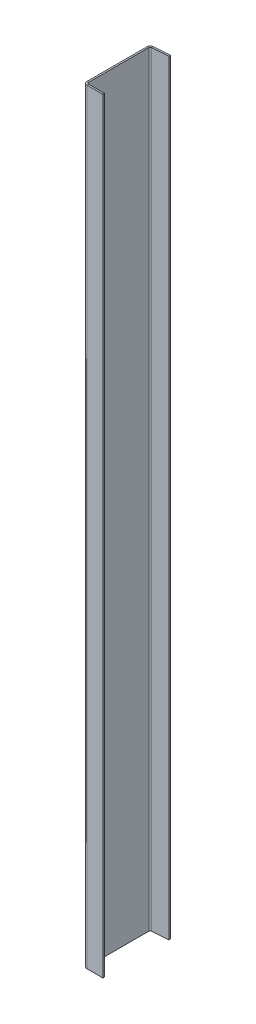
ISO-10303-21;
HEADER;
FILE_DESCRIPTION(('STEP AP214'),'2;1');
FILE_NAME('part.step','',(''),(''),'','','');
FILE_SCHEMA(('AUTOMOTIVE_DESIGN { 1 0 10303 214 1 1 1 1 }'));
ENDSEC;
DATA;
#1=APPLICATION_CONTEXT('core data for automotive mechanical design processes');
#2=APPLICATION_PROTOCOL_DEFINITION('international standard','automotive_design',2000,#1);
#3=PRODUCT_CONTEXT('',#1,'mechanical');
#4=PRODUCT('Part','Part','',(#3));
#5=PRODUCT_RELATED_PRODUCT_CATEGORY('part','',(#4));
#6=PRODUCT_DEFINITION_FORMATION('','',#4);
#7=PRODUCT_DEFINITION_CONTEXT('part definition',#1,'design');
#8=PRODUCT_DEFINITION('design','',#6,#7);
#9=PRODUCT_DEFINITION_SHAPE('','',#8);
#10=(LENGTH_UNIT() NAMED_UNIT(*) SI_UNIT(.MILLI.,.METRE.));
#11=(NAMED_UNIT(*) PLANE_ANGLE_UNIT() SI_UNIT($,.RADIAN.));
#12=(NAMED_UNIT(*) SI_UNIT($,.STERADIAN.) SOLID_ANGLE_UNIT());
#13=UNCERTAINTY_MEASURE_WITH_UNIT(LENGTH_MEASURE(1.E-05),#10,'distance_accuracy_value','');
#14=(GEOMETRIC_REPRESENTATION_CONTEXT(3) GLOBAL_UNCERTAINTY_ASSIGNED_CONTEXT((#13)) GLOBAL_UNIT_ASSIGNED_CONTEXT((#10,
#11,#12)) REPRESENTATION_CONTEXT('',''));
#15=CARTESIAN_POINT('',(0.,0.,0.));
#16=DIRECTION('',(0.,0.,1.));
#17=DIRECTION('',(1.,0.,0.));
#18=AXIS2_PLACEMENT_3D('',#15,#16,#17);
#19=CARTESIAN_POINT('',(-3.99680288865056E-12,3048.,-12.6999999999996));
#20=DIRECTION('',(0.,1.,0.));
#21=DIRECTION('',(0.,0.,0.999999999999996));
#22=AXIS2_PLACEMENT_3D('',#19,#20,#21);
#23=PLANE('',#22);
#24=DIRECTION('',(1.,0.,0.));
#25=VECTOR('',#24,1.);
#26=CARTESIAN_POINT('',(-3.99680288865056E-12,3048.,-12.6999999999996));
#27=LINE('',#26,#25);
#28=CARTESIAN_POINT('',(-3.99680288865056E-12,3048.,-12.6999999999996));
#29=VERTEX_POINT('',#28);
#30=CARTESIAN_POINT('',(6.34999999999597,3048.,-12.6999999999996));
#31=VERTEX_POINT('',#30);
#32=EDGE_CURVE('E11',#29,#31,#27,.T.);
#33=ORIENTED_EDGE('',*,*,#32,.F.);
#34=CARTESIAN_POINT('',(12.699999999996,3048.,-12.6999999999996));
#35=DIRECTION('',(0.,1.,0.));
#36=DIRECTION('',(0.,0.,0.999999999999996));
#37=AXIS2_PLACEMENT_3D('',#34,#35,#36);
#38=CIRCLE('',#37,12.7);
#39=CARTESIAN_POINT('',(12.6999999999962,3048.,3.84132829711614E-13));
#40=VERTEX_POINT('',#39);
#41=EDGE_CURVE('E246',#40,#29,#38,.F.);
#42=ORIENTED_EDGE('',*,*,#41,.F.);
#43=DIRECTION('',(0.,0.,0.999999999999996));
#44=VECTOR('',#43,1.);
#45=CARTESIAN_POINT('',(12.699999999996,3048.,-6.3499999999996));
#46=LINE('',#45,#44);
#47=CARTESIAN_POINT('',(12.699999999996,3048.,-6.3499999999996));
#48=VERTEX_POINT('',#47);
#49=EDGE_CURVE('E44',#48,#40,#46,.T.);
#50=ORIENTED_EDGE('',*,*,#49,.F.);
#51=CARTESIAN_POINT('',(12.699999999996,3048.,-12.6999999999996));
#52=DIRECTION('',(0.,1.,0.));
#53=DIRECTION('',(1.,0.,0.));
#54=AXIS2_PLACEMENT_3D('',#51,#52,#53);
#55=CIRCLE('',#54,6.35);
#56=EDGE_CURVE('E145',#48,#31,#55,.F.);
#57=ORIENTED_EDGE('',*,*,#56,.T.);
#58=EDGE_LOOP('',(#33,#42,#50,#57));
#59=FACE_BOUND('',#58,.T.);
#60=ADVANCED_FACE('F36',(#59),#23,.T.);
#61=CARTESIAN_POINT('',(12.699999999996,3048.,-6.3499999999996));
#62=DIRECTION('',(0.,1.,0.));
#63=DIRECTION('',(0.,0.,0.999999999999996));
#64=AXIS2_PLACEMENT_3D('',#61,#62,#63);
#65=PLANE('',#64);
#66=DIRECTION('',(0.,0.,-0.999999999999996));
#67=VECTOR('',#66,1.);
#68=CARTESIAN_POINT('',(-3.99680288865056E-12,3048.,3.82506526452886E-13));
#69=LINE('',#68,#67);
#70=CARTESIAN_POINT('',(-3.99680288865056E-12,3048.,-251.682058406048));
#71=VERTEX_POINT('',#70);
#72=EDGE_CURVE('E139',#29,#71,#69,.T.);
#73=ORIENTED_EDGE('',*,*,#72,.F.);
#74=ORIENTED_EDGE('',*,*,#32,.T.);
#75=DIRECTION('',(0.,0.,-0.999999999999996));
#76=VECTOR('',#75,1.);
#77=CARTESIAN_POINT('',(6.34999999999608,3048.,3.82506526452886E-13));
#78=LINE('',#77,#76);
#79=CARTESIAN_POINT('',(6.34999999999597,3048.,-251.682058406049));
#80=VERTEX_POINT('',#79);
#81=EDGE_CURVE('E136',#31,#80,#78,.T.);
#82=ORIENTED_EDGE('',*,*,#81,.T.);
#83=DIRECTION('',(-1.,0.,0.));
#84=VECTOR('',#83,1.);
#85=CARTESIAN_POINT('',(6.34999999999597,3048.,-251.682058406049));
#86=LINE('',#85,#84);
#87=EDGE_CURVE('E227',#80,#71,#86,.T.);
#88=ORIENTED_EDGE('',*,*,#87,.T.);
#89=EDGE_LOOP('',(#73,#74,#82,#88));
#90=FACE_BOUND('',#89,.T.);
#91=ADVANCED_FACE('F134',(#90),#65,.T.);
#92=CARTESIAN_POINT('',(12.7,0.,0.));
#93=DIRECTION('',(0.,-1.,0.));
#94=DIRECTION('',(0.,0.,-0.999999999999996));
#95=AXIS2_PLACEMENT_3D('',#92,#93,#94);
#96=PLANE('',#95);
#97=DIRECTION('',(0.,0.,-0.999999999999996));
#98=VECTOR('',#97,1.);
#99=CARTESIAN_POINT('',(12.7,0.,0.));
#100=LINE('',#99,#98);
#101=CARTESIAN_POINT('',(12.7,0.,0.));
#102=VERTEX_POINT('',#101);
#103=CARTESIAN_POINT('',(12.7,0.,-6.34999999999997));
#104=VERTEX_POINT('',#103);
#105=EDGE_CURVE('E232',#102,#104,#100,.T.);
#106=ORIENTED_EDGE('',*,*,#105,.F.);
#107=CARTESIAN_POINT('',(12.6999999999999,0.,-12.6999999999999));
#108=DIRECTION('',(0.,1.,0.));
#109=DIRECTION('',(0.,0.,0.999999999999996));
#110=AXIS2_PLACEMENT_3D('',#107,#108,#109);
#111=CIRCLE('',#110,12.7);
#112=CARTESIAN_POINT('',(0.,0.,-12.6999999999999));
#113=VERTEX_POINT('',#112);
#114=EDGE_CURVE('E184',#102,#113,#111,.F.);
#115=ORIENTED_EDGE('',*,*,#114,.T.);
#116=DIRECTION('',(-1.,0.,0.));
#117=VECTOR('',#116,1.);
#118=CARTESIAN_POINT('',(6.34999999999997,0.,-12.6999999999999));
#119=LINE('',#118,#117);
#120=CARTESIAN_POINT('',(6.34999999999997,0.,-12.6999999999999));
#121=VERTEX_POINT('',#120);
#122=EDGE_CURVE('E230',#121,#113,#119,.T.);
#123=ORIENTED_EDGE('',*,*,#122,.F.);
#124=CARTESIAN_POINT('',(12.6999999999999,0.,-12.6999999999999));
#125=DIRECTION('',(0.,1.,0.));
#126=DIRECTION('',(1.,0.,0.));
#127=AXIS2_PLACEMENT_3D('',#124,#125,#126);
#128=CIRCLE('',#127,6.35);
#129=EDGE_CURVE('E157',#104,#121,#128,.F.);
#130=ORIENTED_EDGE('',*,*,#129,.F.);
#131=EDGE_LOOP('',(#106,#115,#123,#130));
#132=FACE_BOUND('',#131,.T.);
#133=ADVANCED_FACE('F284',(#132),#96,.T.);
#134=CARTESIAN_POINT('',(6.34999999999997,0.,-12.6999999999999));
#135=DIRECTION('',(0.,-1.,0.));
#136=DIRECTION('',(0.,0.,-0.999999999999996));
#137=AXIS2_PLACEMENT_3D('',#134,#135,#136);
#138=PLANE('',#137);
#139=DIRECTION('',(-1.,0.,0.));
#140=VECTOR('',#139,1.);
#141=CARTESIAN_POINT('',(76.2,0.,0.));
#142=LINE('',#141,#140);
#143=CARTESIAN_POINT('',(76.2,0.,0.));
#144=VERTEX_POINT('',#143);
#145=EDGE_CURVE('E187',#144,#102,#142,.T.);
#146=ORIENTED_EDGE('',*,*,#145,.T.);
#147=ORIENTED_EDGE('',*,*,#105,.T.);
#148=DIRECTION('',(-1.,0.,0.));
#149=VECTOR('',#148,1.);
#150=CARTESIAN_POINT('',(76.1999999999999,0.,-6.34999999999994));
#151=LINE('',#150,#149);
#152=CARTESIAN_POINT('',(76.1999999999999,0.,-6.34999999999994));
#153=VERTEX_POINT('',#152);
#154=EDGE_CURVE('E193',#153,#104,#151,.T.);
#155=ORIENTED_EDGE('',*,*,#154,.F.);
#156=DIRECTION('',(0.,0.,0.999999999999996));
#157=VECTOR('',#156,1.);
#158=CARTESIAN_POINT('',(76.1999999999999,0.,-6.34999999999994));
#159=LINE('',#158,#157);
#160=EDGE_CURVE('E190',#153,#144,#159,.T.);
#161=ORIENTED_EDGE('',*,*,#160,.T.);
#162=EDGE_LOOP('',(#146,#147,#155,#161));
#163=FACE_BOUND('',#162,.T.);
#164=ADVANCED_FACE('F287',(#163),#138,.T.);
#165=CARTESIAN_POINT('',(11.8140927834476,3048.,-264.351121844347));
#166=DIRECTION('',(0.,1.,0.));
#167=DIRECTION('',(0.,0.,0.999999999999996));
#168=AXIS2_PLACEMENT_3D('',#165,#166,#167);
#169=PLANE('',#168);
#170=DIRECTION('',(0.0697564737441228,0.,0.99756405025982));
#171=VECTOR('',#170,1.);
#172=CARTESIAN_POINT('',(11.8140927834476,3048.,-264.351121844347));
#173=LINE('',#172,#171);
#174=CARTESIAN_POINT('',(11.8140927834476,3048.,-264.351121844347));
#175=VERTEX_POINT('',#174);
#176=CARTESIAN_POINT('',(12.2570463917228,3048.,-258.016590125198));
#177=VERTEX_POINT('',#176);
#178=EDGE_CURVE('E52',#175,#177,#173,.T.);
#179=ORIENTED_EDGE('',*,*,#178,.F.);
#180=CARTESIAN_POINT('',(12.699999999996,3048.,-251.682058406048));
#181=DIRECTION('',(0.,1.,0.));
#182=DIRECTION('',(0.,0.,0.999999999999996));
#183=AXIS2_PLACEMENT_3D('',#180,#181,#182);
#184=CIRCLE('',#183,12.7);
#185=EDGE_CURVE('E256',#71,#175,#184,.F.);
#186=ORIENTED_EDGE('',*,*,#185,.F.);
#187=ORIENTED_EDGE('',*,*,#87,.F.);
#188=CARTESIAN_POINT('',(12.699999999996,3048.,-251.682058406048));
#189=DIRECTION('',(0.,1.,0.));
#190=DIRECTION('',(1.,0.,0.));
#191=AXIS2_PLACEMENT_3D('',#188,#189,#190);
#192=CIRCLE('',#191,6.35);
#193=EDGE_CURVE('E165',#80,#177,#192,.F.);
#194=ORIENTED_EDGE('',*,*,#193,.T.);
#195=EDGE_LOOP('',(#179,#186,#187,#194));
#196=FACE_BOUND('',#195,.T.);
#197=ADVANCED_FACE('F279',(#196),#169,.T.);
#198=CARTESIAN_POINT('',(6.34999999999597,3048.,-251.682058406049));
#199=DIRECTION('',(0.,1.,0.));
#200=DIRECTION('',(0.,0.,0.999999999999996));
#201=AXIS2_PLACEMENT_3D('',#198,#199,#200);
#202=PLANE('',#201);
#203=DIRECTION('',(0.997564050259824,0.,-0.0697564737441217));
#204=VECTOR('',#203,1.);
#205=CARTESIAN_POINT('',(-1.99840144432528E-12,3048.,-263.524999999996));
#206=LINE('',#205,#204);
#207=CARTESIAN_POINT('',(76.0143806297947,3048.,-268.840443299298));
#208=VERTEX_POINT('',#207);
#209=EDGE_CURVE('E259',#175,#208,#206,.T.);
#210=ORIENTED_EDGE('',*,*,#209,.F.);
#211=ORIENTED_EDGE('',*,*,#178,.T.);
#212=DIRECTION('',(0.997564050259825,0.,-0.0697564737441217));
#213=VECTOR('',#212,1.);
#214=CARTESIAN_POINT('',(0.442953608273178,3048.,-257.190468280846));
#215=LINE('',#214,#213);
#216=CARTESIAN_POINT('',(76.4573342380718,3048.,-262.505911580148));
#217=VERTEX_POINT('',#216);
#218=EDGE_CURVE('E106',#177,#217,#215,.T.);
#219=ORIENTED_EDGE('',*,*,#218,.T.);
#220=DIRECTION('',(0.0697564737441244,0.,0.99756405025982));
#221=VECTOR('',#220,1.);
#222=CARTESIAN_POINT('',(76.0143806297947,3048.,-268.840443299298));
#223=LINE('',#222,#221);
#224=EDGE_CURVE('E262',#208,#217,#223,.T.);
#225=ORIENTED_EDGE('',*,*,#224,.F.);
#226=EDGE_LOOP('',(#210,#211,#219,#225));
#227=FACE_BOUND('',#226,.T.);
#228=ADVANCED_FACE('F268',(#227),#202,.T.);
#229=CARTESIAN_POINT('',(0.,0.,-251.682058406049));
#230=DIRECTION('',(0.,-1.,0.));
#231=DIRECTION('',(0.,0.,-0.999999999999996));
#232=AXIS2_PLACEMENT_3D('',#229,#230,#231);
#233=PLANE('',#232);
#234=DIRECTION('',(1.,0.,0.));
#235=VECTOR('',#234,1.);
#236=CARTESIAN_POINT('',(0.,0.,-251.682058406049));
#237=LINE('',#236,#235);
#238=CARTESIAN_POINT('',(0.,0.,-251.682058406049));
#239=VERTEX_POINT('',#238);
#240=CARTESIAN_POINT('',(6.34999999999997,0.,-251.68205840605));
#241=VERTEX_POINT('',#240);
#242=EDGE_CURVE('E93',#239,#241,#237,.T.);
#243=ORIENTED_EDGE('',*,*,#242,.F.);
#244=CARTESIAN_POINT('',(12.6999999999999,0.,-251.682058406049));
#245=DIRECTION('',(0.,1.,0.));
#246=DIRECTION('',(0.,0.,0.999999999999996));
#247=AXIS2_PLACEMENT_3D('',#244,#245,#246);
#248=CIRCLE('',#247,12.7);
#249=CARTESIAN_POINT('',(11.8140927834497,0.,-264.351121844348));
#250=VERTEX_POINT('',#249);
#251=EDGE_CURVE('E180',#239,#250,#248,.F.);
#252=ORIENTED_EDGE('',*,*,#251,.T.);
#253=DIRECTION('',(-0.0697564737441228,0.,-0.99756405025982));
#254=VECTOR('',#253,1.);
#255=CARTESIAN_POINT('',(12.2570463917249,0.,-258.016590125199));
#256=LINE('',#255,#254);
#257=CARTESIAN_POINT('',(12.2570463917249,0.,-258.016590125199));
#258=VERTEX_POINT('',#257);
#259=EDGE_CURVE('E100',#258,#250,#256,.T.);
#260=ORIENTED_EDGE('',*,*,#259,.F.);
#261=CARTESIAN_POINT('',(12.6999999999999,0.,-251.682058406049));
#262=DIRECTION('',(0.,1.,0.));
#263=DIRECTION('',(1.,0.,0.));
#264=AXIS2_PLACEMENT_3D('',#261,#262,#263);
#265=CIRCLE('',#264,6.35);
#266=EDGE_CURVE('E199',#241,#258,#265,.F.);
#267=ORIENTED_EDGE('',*,*,#266,.F.);
#268=EDGE_LOOP('',(#243,#252,#260,#267));
#269=FACE_BOUND('',#268,.T.);
#270=ADVANCED_FACE('F316',(#269),#233,.T.);
#271=CARTESIAN_POINT('',(12.2570463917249,0.,-258.016590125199));
#272=DIRECTION('',(0.,-1.,0.));
#273=DIRECTION('',(0.,0.,-0.999999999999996));
#274=AXIS2_PLACEMENT_3D('',#271,#272,#273);
#275=PLANE('',#274);
#276=DIRECTION('',(0.,0.,-0.999999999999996));
#277=VECTOR('',#276,1.);
#278=CARTESIAN_POINT('',(0.,0.,0.));
#279=LINE('',#278,#277);
#280=EDGE_CURVE('E182',#113,#239,#279,.T.);
#281=ORIENTED_EDGE('',*,*,#280,.T.);
#282=ORIENTED_EDGE('',*,*,#242,.T.);
#283=DIRECTION('',(0.,0.,-0.999999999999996));
#284=VECTOR('',#283,1.);
#285=CARTESIAN_POINT('',(6.34999999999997,0.,0.));
#286=LINE('',#285,#284);
#287=EDGE_CURVE('E197',#121,#241,#286,.T.);
#288=ORIENTED_EDGE('',*,*,#287,.F.);
#289=ORIENTED_EDGE('',*,*,#122,.T.);
#290=EDGE_LOOP('',(#281,#282,#288,#289));
#291=FACE_BOUND('',#290,.T.);
#292=ADVANCED_FACE('F319',(#291),#275,.T.);
#293=CARTESIAN_POINT('',(0.442953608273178,3048.,-257.190468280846));
#294=DIRECTION('',(-0.0697564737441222,0.,-0.99756405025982));
#295=DIRECTION('',(-0.997564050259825,0.,0.0697564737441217));
#296=AXIS2_PLACEMENT_3D('',#293,#294,#295);
#297=PLANE('',#296);
#298=DIRECTION('',(0.997564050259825,0.,-0.0697564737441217));
#299=VECTOR('',#298,1.);
#300=CARTESIAN_POINT('',(0.442953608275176,0.,-257.190468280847));
#301=LINE('',#300,#299);
#302=CARTESIAN_POINT('',(76.4573342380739,0.,-262.50591158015));
#303=VERTEX_POINT('',#302);
#304=EDGE_CURVE('E171',#258,#303,#301,.T.);
#305=ORIENTED_EDGE('',*,*,#304,.T.);
#306=DIRECTION('',(0.,-1.,0.));
#307=VECTOR('',#306,1.);
#308=CARTESIAN_POINT('',(76.4573342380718,3048.,-262.505911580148));
#309=LINE('',#308,#307);
#310=EDGE_CURVE('E223',#217,#303,#309,.T.);
#311=ORIENTED_EDGE('',*,*,#310,.F.);
#312=ORIENTED_EDGE('',*,*,#218,.F.);
#313=DIRECTION('',(0.,-1.,0.));
#314=VECTOR('',#313,1.);
#315=CARTESIAN_POINT('',(12.2570463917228,3048.,-258.016590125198));
#316=LINE('',#315,#314);
#317=EDGE_CURVE('E167',#177,#258,#316,.T.);
#318=ORIENTED_EDGE('',*,*,#317,.T.);
#319=EDGE_LOOP('',(#305,#311,#312,#318));
#320=FACE_BOUND('',#319,.T.);
#321=ADVANCED_FACE('F322',(#320),#297,.F.);
#322=CARTESIAN_POINT('',(76.0143806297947,3048.,-268.840443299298));
#323=DIRECTION('',(0.997564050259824,0.,-0.0697564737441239));
#324=DIRECTION('',(-0.0697564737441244,0.,-0.99756405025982));
#325=AXIS2_PLACEMENT_3D('',#322,#323,#324);
#326=PLANE('',#325);
#327=DIRECTION('',(0.0697564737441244,0.,0.99756405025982));
#328=VECTOR('',#327,1.);
#329=CARTESIAN_POINT('',(76.0143806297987,0.,-268.840443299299));
#330=LINE('',#329,#328);
#331=CARTESIAN_POINT('',(76.0143806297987,0.,-268.840443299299));
#332=VERTEX_POINT('',#331);
#333=EDGE_CURVE('E174',#332,#303,#330,.T.);
#334=ORIENTED_EDGE('',*,*,#333,.F.);
#335=DIRECTION('',(0.,-1.,0.));
#336=VECTOR('',#335,1.);
#337=CARTESIAN_POINT('',(76.0143806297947,3048.,-268.840443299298));
#338=LINE('',#337,#336);
#339=EDGE_CURVE('E221',#208,#332,#338,.T.);
#340=ORIENTED_EDGE('',*,*,#339,.F.);
#341=ORIENTED_EDGE('',*,*,#224,.T.);
#342=ORIENTED_EDGE('',*,*,#310,.T.);
#343=EDGE_LOOP('',(#334,#340,#341,#342));
#344=FACE_BOUND('',#343,.T.);
#345=ADVANCED_FACE('F267',(#344),#326,.T.);
#346=CARTESIAN_POINT('',(-1.99840144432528E-12,3048.,-263.524999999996));
#347=DIRECTION('',(-0.0697564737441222,0.,-0.99756405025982));
#348=DIRECTION('',(-0.997564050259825,0.,0.0697564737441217));
#349=AXIS2_PLACEMENT_3D('',#346,#347,#348);
#350=PLANE('',#349);
#351=DIRECTION('',(0.997564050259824,0.,-0.0697564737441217));
#352=VECTOR('',#351,1.);
#353=CARTESIAN_POINT('',(0.,0.,-263.524999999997));
#354=LINE('',#353,#352);
#355=EDGE_CURVE('E177',#250,#332,#354,.T.);
#356=ORIENTED_EDGE('',*,*,#355,.F.);
#357=DIRECTION('',(0.,-1.,0.));
#358=VECTOR('',#357,1.);
#359=CARTESIAN_POINT('',(11.8140927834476,3048.,-264.351121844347));
#360=LINE('',#359,#358);
#361=EDGE_CURVE('E218',#175,#250,#360,.T.);
#362=ORIENTED_EDGE('',*,*,#361,.F.);
#363=ORIENTED_EDGE('',*,*,#209,.T.);
#364=ORIENTED_EDGE('',*,*,#339,.T.);
#365=EDGE_LOOP('',(#356,#362,#363,#364));
#366=FACE_BOUND('',#365,.T.);
#367=ADVANCED_FACE('F272',(#366),#350,.T.);
#368=CARTESIAN_POINT('',(12.699999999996,3048.,-251.682058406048));
#369=DIRECTION('',(0.,-1.,0.));
#370=DIRECTION('',(0.,0.,-0.999999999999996));
#371=AXIS2_PLACEMENT_3D('',#368,#369,#370);
#372=CYLINDRICAL_SURFACE('',#371,12.7);
#373=ORIENTED_EDGE('',*,*,#251,.F.);
#374=DIRECTION('',(0.,-1.,0.));
#375=VECTOR('',#374,1.);
#376=CARTESIAN_POINT('',(-3.99680288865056E-12,3048.,-251.682058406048));
#377=LINE('',#376,#375);
#378=EDGE_CURVE('E215',#71,#239,#377,.T.);
#379=ORIENTED_EDGE('',*,*,#378,.F.);
#380=ORIENTED_EDGE('',*,*,#185,.T.);
#381=ORIENTED_EDGE('',*,*,#361,.T.);
#382=EDGE_LOOP('',(#373,#379,#380,#381));
#383=FACE_BOUND('',#382,.T.);
#384=ADVANCED_FACE('F275',(#383),#372,.T.);
#385=CARTESIAN_POINT('',(-3.99680288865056E-12,3048.,3.82506526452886E-13));
#386=DIRECTION('',(-1.,0.,0.));
#387=DIRECTION('',(0.,0.,0.999999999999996));
#388=AXIS2_PLACEMENT_3D('',#385,#386,#387);
#389=PLANE('',#388);
#390=ORIENTED_EDGE('',*,*,#280,.F.);
#391=DIRECTION('',(0.,-1.,0.));
#392=VECTOR('',#391,1.);
#393=CARTESIAN_POINT('',(-3.99680288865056E-12,3048.,-12.6999999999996));
#394=LINE('',#393,#392);
#395=EDGE_CURVE('E212',#29,#113,#394,.T.);
#396=ORIENTED_EDGE('',*,*,#395,.F.);
#397=ORIENTED_EDGE('',*,*,#72,.T.);
#398=ORIENTED_EDGE('',*,*,#378,.T.);
#399=EDGE_LOOP('',(#390,#396,#397,#398));
#400=FACE_BOUND('',#399,.T.);
#401=ADVANCED_FACE('F282',(#400),#389,.T.);
#402=CARTESIAN_POINT('',(12.699999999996,3048.,-12.6999999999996));
#403=DIRECTION('',(0.,-1.,0.));
#404=DIRECTION('',(0.,0.,-0.999999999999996));
#405=AXIS2_PLACEMENT_3D('',#402,#403,#404);
#406=CYLINDRICAL_SURFACE('',#405,12.7);
#407=ORIENTED_EDGE('',*,*,#114,.F.);
#408=DIRECTION('',(0.,-1.,0.));
#409=VECTOR('',#408,1.);
#410=CARTESIAN_POINT('',(12.6999999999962,3048.,3.84132829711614E-13));
#411=LINE('',#410,#409);
#412=EDGE_CURVE('E209',#40,#102,#411,.T.);
#413=ORIENTED_EDGE('',*,*,#412,.F.);
#414=ORIENTED_EDGE('',*,*,#41,.T.);
#415=ORIENTED_EDGE('',*,*,#395,.T.);
#416=EDGE_LOOP('',(#407,#413,#414,#415));
#417=FACE_BOUND('',#416,.T.);
#418=ADVANCED_FACE('F245',(#417),#406,.T.);
#419=CARTESIAN_POINT('',(76.1999999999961,3048.,3.76760254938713E-13));
#420=DIRECTION('',(0.,0.,0.999999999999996));
#421=DIRECTION('',(1.,0.,0.));
#422=AXIS2_PLACEMENT_3D('',#419,#420,#421);
#423=PLANE('',#422);
#424=ORIENTED_EDGE('',*,*,#145,.F.);
#425=DIRECTION('',(0.,-1.,0.));
#426=VECTOR('',#425,1.);
#427=CARTESIAN_POINT('',(76.1999999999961,3048.,3.76760254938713E-13));
#428=LINE('',#427,#426);
#429=CARTESIAN_POINT('',(76.1999999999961,3048.,3.76760254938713E-13));
#430=VERTEX_POINT('',#429);
#431=EDGE_CURVE('E207',#430,#144,#428,.T.);
#432=ORIENTED_EDGE('',*,*,#431,.F.);
#433=DIRECTION('',(-1.,0.,0.));
#434=VECTOR('',#433,1.);
#435=CARTESIAN_POINT('',(76.1999999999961,3048.,3.76760254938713E-13));
#436=LINE('',#435,#434);
#437=EDGE_CURVE('E239',#430,#40,#436,.T.);
#438=ORIENTED_EDGE('',*,*,#437,.T.);
#439=ORIENTED_EDGE('',*,*,#412,.T.);
#440=EDGE_LOOP('',(#424,#432,#438,#439));
#441=FACE_BOUND('',#440,.T.);
#442=ADVANCED_FACE('F250',(#441),#423,.T.);
#443=CARTESIAN_POINT('',(76.1999999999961,3048.,-6.34999999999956));
#444=DIRECTION('',(1.,0.,0.));
#445=DIRECTION('',(0.,0.,-0.999999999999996));
#446=AXIS2_PLACEMENT_3D('',#443,#444,#445);
#447=PLANE('',#446);
#448=ORIENTED_EDGE('',*,*,#160,.F.);
#449=DIRECTION('',(0.,-1.,0.));
#450=VECTOR('',#449,1.);
#451=CARTESIAN_POINT('',(76.1999999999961,3048.,-6.34999999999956));
#452=LINE('',#451,#450);
#453=CARTESIAN_POINT('',(76.1999999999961,3048.,-6.34999999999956));
#454=VERTEX_POINT('',#453);
#455=EDGE_CURVE('E205',#454,#153,#452,.T.);
#456=ORIENTED_EDGE('',*,*,#455,.F.);
#457=DIRECTION('',(0.,0.,0.999999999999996));
#458=VECTOR('',#457,1.);
#459=CARTESIAN_POINT('',(76.1999999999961,3048.,-6.34999999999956));
#460=LINE('',#459,#458);
#461=EDGE_CURVE('E251',#454,#430,#460,.T.);
#462=ORIENTED_EDGE('',*,*,#461,.T.);
#463=ORIENTED_EDGE('',*,*,#431,.T.);
#464=EDGE_LOOP('',(#448,#456,#462,#463));
#465=FACE_BOUND('',#464,.T.);
#466=ADVANCED_FACE('F292',(#465),#447,.T.);
#467=CARTESIAN_POINT('',(76.1999999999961,3048.,-6.34999999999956));
#468=DIRECTION('',(0.,0.,0.999999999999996));
#469=DIRECTION('',(1.,0.,0.));
#470=AXIS2_PLACEMENT_3D('',#467,#468,#469);
#471=PLANE('',#470);
#472=ORIENTED_EDGE('',*,*,#154,.T.);
#473=DIRECTION('',(0.,-1.,0.));
#474=VECTOR('',#473,1.);
#475=CARTESIAN_POINT('',(12.699999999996,3048.,-6.3499999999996));
#476=LINE('',#475,#474);
#477=EDGE_CURVE('E159',#48,#104,#476,.T.);
#478=ORIENTED_EDGE('',*,*,#477,.F.);
#479=DIRECTION('',(-1.,0.,0.));
#480=VECTOR('',#479,1.);
#481=CARTESIAN_POINT('',(76.1999999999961,3048.,-6.34999999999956));
#482=LINE('',#481,#480);
#483=EDGE_CURVE('E150',#454,#48,#482,.T.);
#484=ORIENTED_EDGE('',*,*,#483,.F.);
#485=ORIENTED_EDGE('',*,*,#455,.T.);
#486=EDGE_LOOP('',(#472,#478,#484,#485));
#487=FACE_BOUND('',#486,.T.);
#488=ADVANCED_FACE('F290',(#487),#471,.F.);
#489=CARTESIAN_POINT('',(12.699999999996,3048.,-12.6999999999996));
#490=DIRECTION('',(0.,-1.,0.));
#491=DIRECTION('',(0.,0.,-0.999999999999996));
#492=AXIS2_PLACEMENT_3D('',#489,#490,#491);
#493=CYLINDRICAL_SURFACE('',#492,6.35);
#494=ORIENTED_EDGE('',*,*,#129,.T.);
#495=DIRECTION('',(0.,-1.,0.));
#496=VECTOR('',#495,1.);
#497=CARTESIAN_POINT('',(6.34999999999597,3048.,-12.6999999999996));
#498=LINE('',#497,#496);
#499=EDGE_CURVE('E154',#31,#121,#498,.T.);
#500=ORIENTED_EDGE('',*,*,#499,.F.);
#501=ORIENTED_EDGE('',*,*,#56,.F.);
#502=ORIENTED_EDGE('',*,*,#477,.T.);
#503=EDGE_LOOP('',(#494,#500,#501,#502));
#504=FACE_BOUND('',#503,.T.);
#505=ADVANCED_FACE('F155',(#504),#493,.F.);
#506=CARTESIAN_POINT('',(6.34999999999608,3048.,3.82506526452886E-13));
#507=DIRECTION('',(-1.,0.,0.));
#508=DIRECTION('',(0.,0.,0.999999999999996));
#509=AXIS2_PLACEMENT_3D('',#506,#507,#508);
#510=PLANE('',#509);
#511=ORIENTED_EDGE('',*,*,#287,.T.);
#512=DIRECTION('',(0.,-1.,0.));
#513=VECTOR('',#512,1.);
#514=CARTESIAN_POINT('',(6.34999999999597,3048.,-251.682058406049));
#515=LINE('',#514,#513);
#516=EDGE_CURVE('E160',#80,#241,#515,.T.);
#517=ORIENTED_EDGE('',*,*,#516,.F.);
#518=ORIENTED_EDGE('',*,*,#81,.F.);
#519=ORIENTED_EDGE('',*,*,#499,.T.);
#520=EDGE_LOOP('',(#511,#517,#518,#519));
#521=FACE_BOUND('',#520,.T.);
#522=ADVANCED_FACE('F162',(#521),#510,.F.);
#523=CARTESIAN_POINT('',(12.699999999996,3048.,-251.682058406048));
#524=DIRECTION('',(0.,-1.,0.));
#525=DIRECTION('',(0.,0.,-0.999999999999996));
#526=AXIS2_PLACEMENT_3D('',#523,#524,#525);
#527=CYLINDRICAL_SURFACE('',#526,6.35);
#528=ORIENTED_EDGE('',*,*,#266,.T.);
#529=ORIENTED_EDGE('',*,*,#317,.F.);
#530=ORIENTED_EDGE('',*,*,#193,.F.);
#531=ORIENTED_EDGE('',*,*,#516,.T.);
#532=EDGE_LOOP('',(#528,#529,#530,#531));
#533=FACE_BOUND('',#532,.T.);
#534=ADVANCED_FACE('F374',(#533),#527,.F.);
#535=CARTESIAN_POINT('',(12.699999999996,3048.,-251.682058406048));
#536=DIRECTION('',(0.,1.,0.));
#537=DIRECTION('',(1.,0.,0.));
#538=AXIS2_PLACEMENT_3D('',#535,#536,#537);
#539=PLANE('',#538);
#540=ORIENTED_EDGE('',*,*,#483,.T.);
#541=ORIENTED_EDGE('',*,*,#49,.T.);
#542=ORIENTED_EDGE('',*,*,#437,.F.);
#543=ORIENTED_EDGE('',*,*,#461,.F.);
#544=EDGE_LOOP('',(#540,#541,#542,#543));
#545=FACE_BOUND('',#544,.T.);
#546=ADVANCED_FACE('F236',(#545),#539,.T.);
#547=CARTESIAN_POINT('',(12.6999999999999,0.,-251.682058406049));
#548=DIRECTION('',(0.,1.,0.));
#549=DIRECTION('',(1.,0.,0.));
#550=AXIS2_PLACEMENT_3D('',#547,#548,#549);
#551=PLANE('',#550);
#552=ORIENTED_EDGE('',*,*,#304,.F.);
#553=ORIENTED_EDGE('',*,*,#259,.T.);
#554=ORIENTED_EDGE('',*,*,#355,.T.);
#555=ORIENTED_EDGE('',*,*,#333,.T.);
#556=EDGE_LOOP('',(#552,#553,#554,#555));
#557=FACE_BOUND('',#556,.T.);
#558=ADVANCED_FACE('F394',(#557),#551,.F.);
#559=CLOSED_SHELL('',(#60,#91,#133,#164,#197,#228,#270,#292,#321,#345,#367,#384,#401,#418,#442,
#466,#488,#505,#522,#534,#546,#558));
#560=MANIFOLD_SOLID_BREP('B2',#559);
#561=ADVANCED_BREP_SHAPE_REPRESENTATION('',(#18,#560),#14);
#562=SHAPE_DEFINITION_REPRESENTATION(#9,#561);
ENDSEC;
END-ISO-10303-21;
